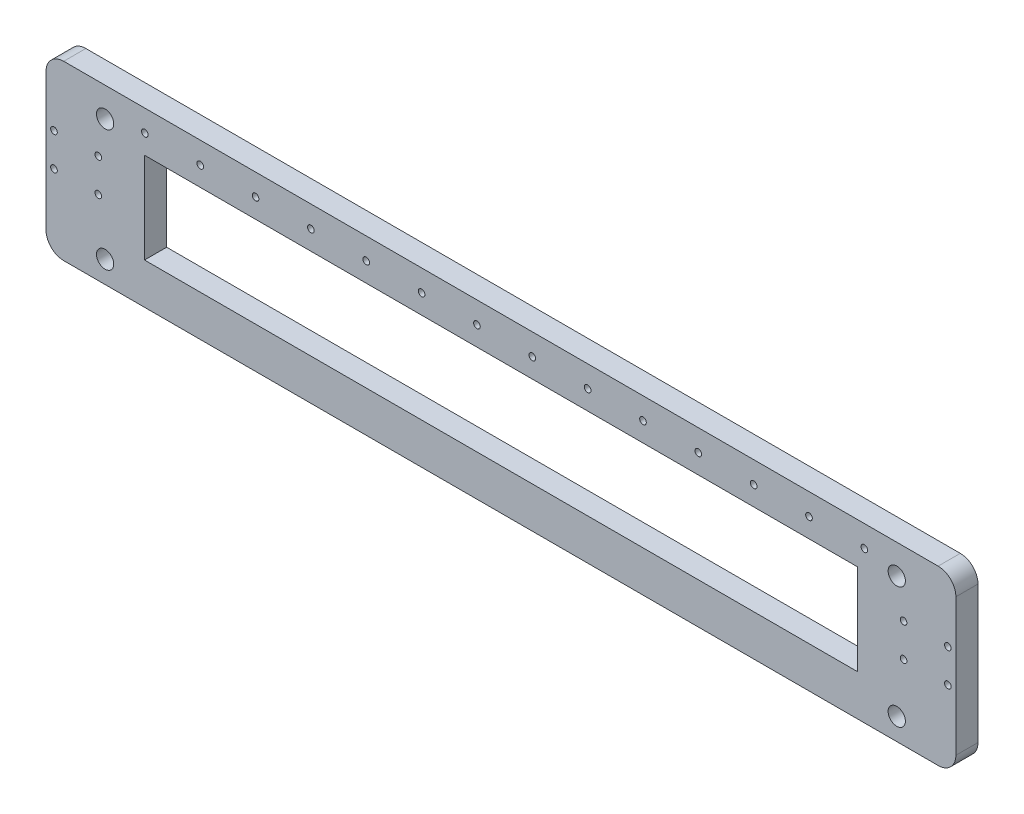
from build123d import *

# Parameters (mm, degrees)
SKETCH1_W           = 322
SKETCH1_H           = 41
BOSS_EXTRUDE1_DEPTH = 10
SKETCH2_R           = 3.9
SKETCH2_R_2         = 1.5
CUT_EXTRUDE1_DEPTH  = 15
SKETCH3_R           = 1.5
CUT_EXTRUDE2_DEPTH  = 15


with BuildPart() as part:
    # Sketch1 → Boss-Extrude1 (new body)
    with BuildSketch(Plane.XY):
        with BuildLine():
            Line((-197.5, 39), (197.5, 39))
            ThreePointArc((197.5, 39), (203.156854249, 36.656854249), (205.5, 31))
            Line((205.5, 31), (205.5, -31))
            ThreePointArc((205.5, -31), (203.156854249, -36.656854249), (197.5, -39))
            Line((197.5, -39), (-197.5, -39))
            ThreePointArc((-197.5, -39), (-203.156854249, -36.656854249), (-205.5, -31))
            Line((-205.5, -31), (-205.5, 31))
            ThreePointArc((-205.5, 31), (-203.156854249, 36.656854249), (-197.5, 39))
        make_face()
        Rectangle(SKETCH1_W, SKETCH1_H, mode=Mode.SUBTRACT)
    extrude(amount=BOSS_EXTRUDE1_DEPTH)

    # Sketch2 → Cut-Extrude1 (cut)
    with BuildSketch(Plane.XY.offset(10)):
        with Locations((178.8, 25.8)):
            Circle(SKETCH2_R)
        with Locations((181.88, 9.7)):
            Circle(SKETCH2_R_2)
        with Locations((201.9, 9.7)):
            Circle(SKETCH2_R_2)
        with Locations((181.88, -5.3)):
            Circle(SKETCH2_R_2)
        with Locations((201.9, -5.3)):
            Circle(SKETCH2_R_2)
        with Locations((178.8, -29.1)):
            Circle(SKETCH2_R)
        with Locations((-178.8, -29.1)):
            Circle(SKETCH2_R)
        with Locations((-201.9, -5.3)):
            Circle(SKETCH2_R_2)
        with Locations((-181.88, -5.3)):
            Circle(SKETCH2_R_2)
        with Locations((-201.9, 9.7)):
            Circle(SKETCH2_R_2)
        with Locations((-181.88, 9.7)):
            Circle(SKETCH2_R_2)
        with Locations((-178.8, 25.8)):
            Circle(SKETCH2_R)
    extrude(amount=-CUT_EXTRUDE1_DEPTH, mode=Mode.SUBTRACT)

    # Sketch3 → Cut-Extrude2 (cut)
    with BuildSketch(Plane.XY.offset(10)):
        with Locations((-160.835375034, 29.235298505)):
            Circle(SKETCH3_R)
        with Locations((-135.835375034, 29.235298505)):
            Circle(SKETCH3_R)
        with Locations((-110.835375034, 29.235298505)):
            Circle(SKETCH3_R)
        with Locations((-85.835375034, 29.235298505)):
            Circle(SKETCH3_R)
        with Locations((-60.835375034, 29.235298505)):
            Circle(SKETCH3_R)
        with Locations((-35.835375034, 29.235298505)):
            Circle(SKETCH3_R)
        with Locations((-10.835375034, 29.235298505)):
            Circle(SKETCH3_R)
        with Locations((14.164624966, 29.235298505)):
            Circle(SKETCH3_R)
        with Locations((39.164624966, 29.235298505)):
            Circle(SKETCH3_R)
        with Locations((64.164624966, 29.235298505)):
            Circle(SKETCH3_R)
        with Locations((89.164624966, 29.235298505)):
            Circle(SKETCH3_R)
        with Locations((114.164624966, 29.235298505)):
            Circle(SKETCH3_R)
        with Locations((139.164624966, 29.235298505)):
            Circle(SKETCH3_R)
        with Locations((164.164624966, 29.235298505)):
            Circle(SKETCH3_R)
    extrude(amount=-CUT_EXTRUDE2_DEPTH, mode=Mode.SUBTRACT)


solid = part.part
